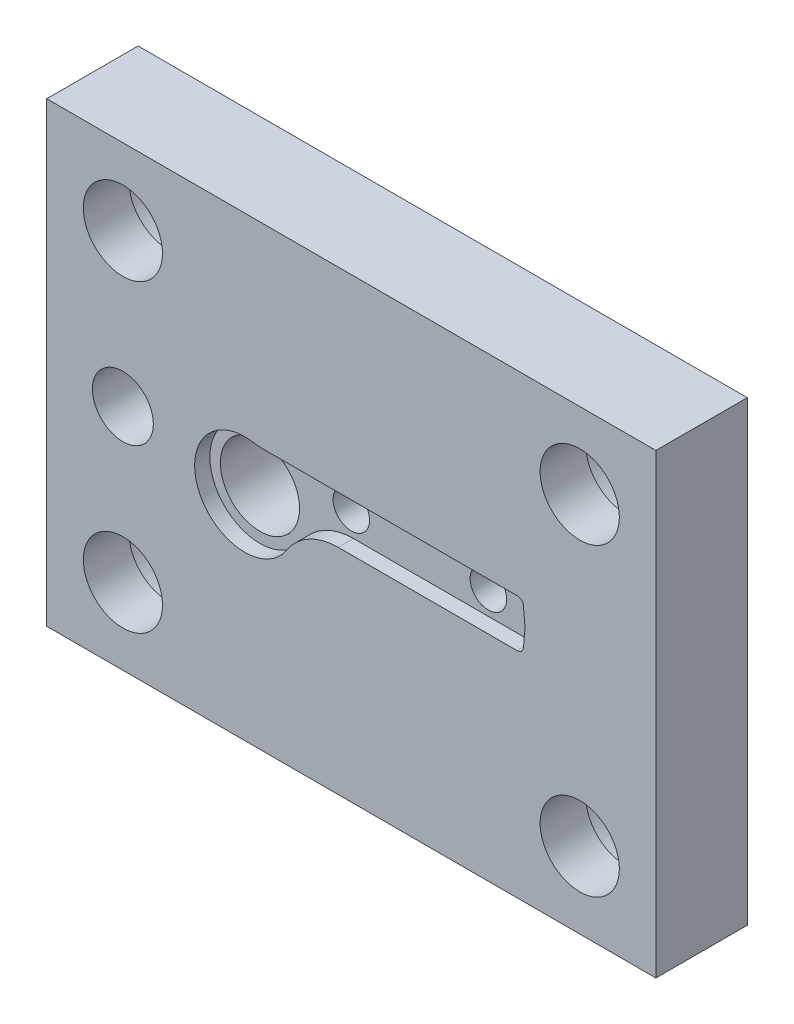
ISO-10303-21;
HEADER;
FILE_DESCRIPTION(('STEP AP214'),'2;1');
FILE_NAME('part.step','',(''),(''),'','','');
FILE_SCHEMA(('AUTOMOTIVE_DESIGN { 1 0 10303 214 1 1 1 1 }'));
ENDSEC;
DATA;
#1=APPLICATION_CONTEXT('core data for automotive mechanical design processes');
#2=APPLICATION_PROTOCOL_DEFINITION('international standard','automotive_design',2000,#1);
#3=PRODUCT_CONTEXT('',#1,'mechanical');
#4=PRODUCT('Part','Part','',(#3));
#5=PRODUCT_RELATED_PRODUCT_CATEGORY('part','',(#4));
#6=PRODUCT_DEFINITION_FORMATION('','',#4);
#7=PRODUCT_DEFINITION_CONTEXT('part definition',#1,'design');
#8=PRODUCT_DEFINITION('design','',#6,#7);
#9=PRODUCT_DEFINITION_SHAPE('','',#8);
#10=(LENGTH_UNIT() NAMED_UNIT(*) SI_UNIT(.MILLI.,.METRE.));
#11=(NAMED_UNIT(*) PLANE_ANGLE_UNIT() SI_UNIT($,.RADIAN.));
#12=(NAMED_UNIT(*) SI_UNIT($,.STERADIAN.) SOLID_ANGLE_UNIT());
#13=UNCERTAINTY_MEASURE_WITH_UNIT(LENGTH_MEASURE(1.E-05),#10,'distance_accuracy_value','');
#14=(GEOMETRIC_REPRESENTATION_CONTEXT(3) GLOBAL_UNCERTAINTY_ASSIGNED_CONTEXT((#13)) GLOBAL_UNIT_ASSIGNED_CONTEXT((#10,
#11,#12)) REPRESENTATION_CONTEXT('',''));
#15=CARTESIAN_POINT('',(0.,0.,0.));
#16=DIRECTION('',(0.,0.,1.));
#17=DIRECTION('',(1.,0.,0.));
#18=AXIS2_PLACEMENT_3D('',#15,#16,#17);
#19=CARTESIAN_POINT('',(0.,0.,30.));
#20=DIRECTION('',(1.,0.,0.));
#21=DIRECTION('',(0.,0.,-1.));
#22=AXIS2_PLACEMENT_3D('',#19,#20,#21);
#23=PLANE('',#22);
#24=DIRECTION('',(0.,-1.,0.));
#25=VECTOR('',#24,1.);
#26=CARTESIAN_POINT('',(0.,0.,0.));
#27=LINE('',#26,#25);
#28=CARTESIAN_POINT('',(0.,150.,0.));
#29=VERTEX_POINT('',#28);
#30=CARTESIAN_POINT('',(0.,0.,0.));
#31=VERTEX_POINT('',#30);
#32=EDGE_CURVE('E203',#29,#31,#27,.T.);
#33=ORIENTED_EDGE('',*,*,#32,.T.);
#34=DIRECTION('',(0.,0.,-1.));
#35=VECTOR('',#34,1.);
#36=CARTESIAN_POINT('',(0.,0.,30.));
#37=LINE('',#36,#35);
#38=CARTESIAN_POINT('',(0.,0.,30.));
#39=VERTEX_POINT('',#38);
#40=EDGE_CURVE('E11',#39,#31,#37,.T.);
#41=ORIENTED_EDGE('',*,*,#40,.F.);
#42=DIRECTION('',(0.,-1.,0.));
#43=VECTOR('',#42,1.);
#44=CARTESIAN_POINT('',(0.,0.,30.));
#45=LINE('',#44,#43);
#46=CARTESIAN_POINT('',(0.,150.,30.));
#47=VERTEX_POINT('',#46);
#48=EDGE_CURVE('E217',#47,#39,#45,.T.);
#49=ORIENTED_EDGE('',*,*,#48,.F.);
#50=DIRECTION('',(0.,0.,-1.));
#51=VECTOR('',#50,1.);
#52=CARTESIAN_POINT('',(0.,150.,30.));
#53=LINE('',#52,#51);
#54=EDGE_CURVE('E223',#47,#29,#53,.T.);
#55=ORIENTED_EDGE('',*,*,#54,.T.);
#56=EDGE_LOOP('',(#33,#41,#49,#55));
#57=FACE_BOUND('',#56,.T.);
#58=ADVANCED_FACE('F31',(#57),#23,.F.);
#59=CARTESIAN_POINT('',(0.,0.,30.));
#60=DIRECTION('',(0.,1.,0.));
#61=DIRECTION('',(0.,0.,1.));
#62=AXIS2_PLACEMENT_3D('',#59,#60,#61);
#63=PLANE('',#62);
#64=DIRECTION('',(1.,0.,0.));
#65=VECTOR('',#64,1.);
#66=CARTESIAN_POINT('',(0.,0.,0.));
#67=LINE('',#66,#65);
#68=CARTESIAN_POINT('',(200.,0.,0.));
#69=VERTEX_POINT('',#68);
#70=EDGE_CURVE('E226',#31,#69,#67,.T.);
#71=ORIENTED_EDGE('',*,*,#70,.T.);
#72=DIRECTION('',(0.,0.,-1.));
#73=VECTOR('',#72,1.);
#74=CARTESIAN_POINT('',(200.,0.,30.));
#75=LINE('',#74,#73);
#76=CARTESIAN_POINT('',(200.,0.,30.));
#77=VERTEX_POINT('',#76);
#78=EDGE_CURVE('E38',#77,#69,#75,.T.);
#79=ORIENTED_EDGE('',*,*,#78,.F.);
#80=DIRECTION('',(1.,0.,0.));
#81=VECTOR('',#80,1.);
#82=CARTESIAN_POINT('',(0.,0.,30.));
#83=LINE('',#82,#81);
#84=EDGE_CURVE('E82',#39,#77,#83,.T.);
#85=ORIENTED_EDGE('',*,*,#84,.F.);
#86=ORIENTED_EDGE('',*,*,#40,.T.);
#87=EDGE_LOOP('',(#71,#79,#85,#86));
#88=FACE_BOUND('',#87,.T.);
#89=ADVANCED_FACE('F255',(#88),#63,.F.);
#90=CARTESIAN_POINT('',(200.,0.,30.));
#91=DIRECTION('',(-1.,0.,0.));
#92=DIRECTION('',(0.,0.,1.));
#93=AXIS2_PLACEMENT_3D('',#90,#91,#92);
#94=PLANE('',#93);
#95=DIRECTION('',(0.,1.,0.));
#96=VECTOR('',#95,1.);
#97=CARTESIAN_POINT('',(200.,0.,0.));
#98=LINE('',#97,#96);
#99=CARTESIAN_POINT('',(200.,150.,0.));
#100=VERTEX_POINT('',#99);
#101=EDGE_CURVE('E228',#69,#100,#98,.T.);
#102=ORIENTED_EDGE('',*,*,#101,.T.);
#103=DIRECTION('',(0.,0.,-1.));
#104=VECTOR('',#103,1.);
#105=CARTESIAN_POINT('',(200.,150.,30.));
#106=LINE('',#105,#104);
#107=CARTESIAN_POINT('',(200.,150.,30.));
#108=VERTEX_POINT('',#107);
#109=EDGE_CURVE('E232',#108,#100,#106,.T.);
#110=ORIENTED_EDGE('',*,*,#109,.F.);
#111=DIRECTION('',(0.,1.,0.));
#112=VECTOR('',#111,1.);
#113=CARTESIAN_POINT('',(200.,0.,30.));
#114=LINE('',#113,#112);
#115=EDGE_CURVE('E220',#77,#108,#114,.T.);
#116=ORIENTED_EDGE('',*,*,#115,.F.);
#117=ORIENTED_EDGE('',*,*,#78,.T.);
#118=EDGE_LOOP('',(#102,#110,#116,#117));
#119=FACE_BOUND('',#118,.T.);
#120=ADVANCED_FACE('F237',(#119),#94,.F.);
#121=CARTESIAN_POINT('',(0.,150.,30.));
#122=DIRECTION('',(0.,-1.,0.));
#123=DIRECTION('',(0.,0.,-1.));
#124=AXIS2_PLACEMENT_3D('',#121,#122,#123);
#125=PLANE('',#124);
#126=DIRECTION('',(-1.,0.,0.));
#127=VECTOR('',#126,1.);
#128=CARTESIAN_POINT('',(0.,150.,0.));
#129=LINE('',#128,#127);
#130=EDGE_CURVE('E75',#100,#29,#129,.T.);
#131=ORIENTED_EDGE('',*,*,#130,.T.);
#132=ORIENTED_EDGE('',*,*,#54,.F.);
#133=DIRECTION('',(-1.,0.,0.));
#134=VECTOR('',#133,1.);
#135=CARTESIAN_POINT('',(0.,150.,30.));
#136=LINE('',#135,#134);
#137=EDGE_CURVE('E54',#108,#47,#136,.T.);
#138=ORIENTED_EDGE('',*,*,#137,.F.);
#139=ORIENTED_EDGE('',*,*,#109,.T.);
#140=EDGE_LOOP('',(#131,#132,#138,#139));
#141=FACE_BOUND('',#140,.T.);
#142=ADVANCED_FACE('F245',(#141),#125,.F.);
#143=CARTESIAN_POINT('',(0.,150.,30.));
#144=DIRECTION('',(0.,0.,-1.));
#145=DIRECTION('',(-1.,0.,0.));
#146=AXIS2_PLACEMENT_3D('',#143,#144,#145);
#147=PLANE('',#146);
#148=CARTESIAN_POINT('',(25.,75.,30.));
#149=DIRECTION('',(0.,0.,1.));
#150=DIRECTION('',(1.,0.,0.));
#151=AXIS2_PLACEMENT_3D('',#148,#149,#150);
#152=CIRCLE('',#151,10.);
#153=CARTESIAN_POINT('',(35.,75.,30.));
#154=VERTEX_POINT('',#153);
#155=EDGE_CURVE('E611',#154,#154,#152,.T.);
#156=ORIENTED_EDGE('',*,*,#155,.F.);
#157=EDGE_LOOP('',(#156));
#158=FACE_BOUND('',#157,.T.);
#159=CARTESIAN_POINT('',(175.,125.,30.));
#160=DIRECTION('',(0.,0.,1.));
#161=DIRECTION('',(1.,0.,0.));
#162=AXIS2_PLACEMENT_3D('',#159,#160,#161);
#163=CIRCLE('',#162,13.);
#164=CARTESIAN_POINT('',(188.,125.,30.));
#165=VERTEX_POINT('',#164);
#166=EDGE_CURVE('E657',#165,#165,#163,.T.);
#167=ORIENTED_EDGE('',*,*,#166,.F.);
#168=EDGE_LOOP('',(#167));
#169=FACE_BOUND('',#168,.T.);
#170=CARTESIAN_POINT('',(175.,25.,30.));
#171=DIRECTION('',(0.,0.,1.));
#172=DIRECTION('',(1.,0.,0.));
#173=AXIS2_PLACEMENT_3D('',#170,#171,#172);
#174=CIRCLE('',#173,13.);
#175=CARTESIAN_POINT('',(188.,25.,30.));
#176=VERTEX_POINT('',#175);
#177=EDGE_CURVE('E660',#176,#176,#174,.T.);
#178=ORIENTED_EDGE('',*,*,#177,.F.);
#179=EDGE_LOOP('',(#178));
#180=FACE_BOUND('',#179,.T.);
#181=CARTESIAN_POINT('',(25.,25.,30.));
#182=DIRECTION('',(0.,0.,1.));
#183=DIRECTION('',(1.,0.,0.));
#184=AXIS2_PLACEMENT_3D('',#181,#182,#183);
#185=CIRCLE('',#184,13.);
#186=CARTESIAN_POINT('',(38.,25.,30.));
#187=VERTEX_POINT('',#186);
#188=EDGE_CURVE('E663',#187,#187,#185,.T.);
#189=ORIENTED_EDGE('',*,*,#188,.F.);
#190=EDGE_LOOP('',(#189));
#191=FACE_BOUND('',#190,.T.);
#192=CARTESIAN_POINT('',(25.,125.,30.));
#193=DIRECTION('',(0.,0.,1.));
#194=DIRECTION('',(1.,0.,0.));
#195=AXIS2_PLACEMENT_3D('',#192,#193,#194);
#196=CIRCLE('',#195,13.);
#197=CARTESIAN_POINT('',(38.,125.,30.));
#198=VERTEX_POINT('',#197);
#199=EDGE_CURVE('E666',#198,#198,#196,.T.);
#200=ORIENTED_EDGE('',*,*,#199,.F.);
#201=EDGE_LOOP('',(#200));
#202=FACE_BOUND('',#201,.T.);
#203=CARTESIAN_POINT('',(65.,70.,30.));
#204=DIRECTION('',(0.,0.,1.));
#205=DIRECTION('',(1.,0.,0.));
#206=AXIS2_PLACEMENT_3D('',#203,#204,#205);
#207=CIRCLE('',#206,16.445);
#208=CARTESIAN_POINT('',(67.7403932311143,86.2150630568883,30.));
#209=VERTEX_POINT('',#208);
#210=CARTESIAN_POINT('',(78.8329287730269,61.1068505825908,30.));
#211=VERTEX_POINT('',#210);
#212=EDGE_CURVE('E181',#209,#211,#207,.T.);
#213=ORIENTED_EDGE('',*,*,#212,.F.);
#214=CARTESIAN_POINT('',(71.0781905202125,105.965,30.));
#215=DIRECTION('',(0.,0.,-1.));
#216=DIRECTION('',(-1.,0.,0.));
#217=AXIS2_PLACEMENT_3D('',#214,#215,#216);
#218=CIRCLE('',#217,20.03);
#219=CARTESIAN_POINT('',(71.0781905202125,85.935,30.));
#220=VERTEX_POINT('',#219);
#221=EDGE_CURVE('E45',#220,#209,#218,.T.);
#222=ORIENTED_EDGE('',*,*,#221,.F.);
#223=DIRECTION('',(-1.,0.,0.));
#224=VECTOR('',#223,1.);
#225=CARTESIAN_POINT('',(71.0781905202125,85.935,30.));
#226=LINE('',#225,#224);
#227=CARTESIAN_POINT('',(154.489847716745,85.935,30.));
#228=VERTEX_POINT('',#227);
#229=EDGE_CURVE('E155',#228,#220,#226,.T.);
#230=ORIENTED_EDGE('',*,*,#229,.F.);
#231=CARTESIAN_POINT('',(154.489847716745,83.905,30.));
#232=DIRECTION('',(0.,0.,1.));
#233=DIRECTION('',(-1.,0.,0.));
#234=AXIS2_PLACEMENT_3D('',#231,#232,#233);
#235=CIRCLE('',#234,2.03000000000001);
#236=CARTESIAN_POINT('',(156.512122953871,84.0819261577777,30.));
#237=VERTEX_POINT('',#236);
#238=EDGE_CURVE('E158',#237,#228,#235,.T.);
#239=ORIENTED_EDGE('',*,*,#238,.F.);
#240=DIRECTION('',(-0.0871557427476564,0.996194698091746,0.));
#241=VECTOR('',#240,1.);
#242=CARTESIAN_POINT('',(156.512122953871,84.0819261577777,30.));
#243=LINE('',#242,#241);
#244=CARTESIAN_POINT('',(157.033723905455,78.12,30.));
#245=VERTEX_POINT('',#244);
#246=EDGE_CURVE('E196',#245,#237,#243,.T.);
#247=ORIENTED_EDGE('',*,*,#246,.F.);
#248=DIRECTION('',(0.0871557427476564,0.996194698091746,0.));
#249=VECTOR('',#248,1.);
#250=CARTESIAN_POINT('',(156.512122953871,72.1580738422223,30.));
#251=LINE('',#250,#249);
#252=CARTESIAN_POINT('',(156.512122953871,72.1580738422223,30.));
#253=VERTEX_POINT('',#252);
#254=EDGE_CURVE('E193',#253,#245,#251,.T.);
#255=ORIENTED_EDGE('',*,*,#254,.F.);
#256=CARTESIAN_POINT('',(154.489847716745,72.335,30.));
#257=DIRECTION('',(0.,0.,1.));
#258=DIRECTION('',(1.,0.,0.));
#259=AXIS2_PLACEMENT_3D('',#256,#257,#258);
#260=CIRCLE('',#259,2.03000000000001);
#261=CARTESIAN_POINT('',(154.489847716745,70.305,30.));
#262=VERTEX_POINT('',#261);
#263=EDGE_CURVE('E190',#262,#253,#260,.T.);
#264=ORIENTED_EDGE('',*,*,#263,.F.);
#265=DIRECTION('',(1.,0.,0.));
#266=VECTOR('',#265,1.);
#267=CARTESIAN_POINT('',(95.6814276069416,70.305,30.));
#268=LINE('',#267,#266);
#269=CARTESIAN_POINT('',(95.6814276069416,70.305,30.));
#270=VERTEX_POINT('',#269);
#271=EDGE_CURVE('E187',#270,#262,#268,.T.);
#272=ORIENTED_EDGE('',*,*,#271,.F.);
#273=CARTESIAN_POINT('',(95.6814276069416,50.275,30.));
#274=DIRECTION('',(0.,0.,-1.));
#275=DIRECTION('',(1.,0.,0.));
#276=AXIS2_PLACEMENT_3D('',#273,#274,#275);
#277=CIRCLE('',#276,20.03);
#278=EDGE_CURVE('E184',#211,#270,#277,.T.);
#279=ORIENTED_EDGE('',*,*,#278,.F.);
#280=EDGE_LOOP('',(#213,#222,#230,#239,#247,#255,#264,#272,#279));
#281=FACE_BOUND('',#280,.T.);
#282=ORIENTED_EDGE('',*,*,#48,.T.);
#283=ORIENTED_EDGE('',*,*,#84,.T.);
#284=ORIENTED_EDGE('',*,*,#115,.T.);
#285=ORIENTED_EDGE('',*,*,#137,.T.);
#286=EDGE_LOOP('',(#282,#283,#284,#285));
#287=FACE_BOUND('',#286,.T.);
#288=ADVANCED_FACE('F247',(#158,#169,#180,#191,#202,#281,#287),#147,.F.);
#289=CARTESIAN_POINT('',(0.,150.,0.));
#290=DIRECTION('',(0.,0.,-1.));
#291=DIRECTION('',(-1.,0.,0.));
#292=AXIS2_PLACEMENT_3D('',#289,#290,#291);
#293=PLANE('',#292);
#294=CARTESIAN_POINT('',(25.,75.,0.));
#295=DIRECTION('',(0.,0.,1.));
#296=DIRECTION('',(1.,0.,0.));
#297=AXIS2_PLACEMENT_3D('',#294,#295,#296);
#298=CIRCLE('',#297,5.99999999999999);
#299=CARTESIAN_POINT('',(31.,75.,0.));
#300=VERTEX_POINT('',#299);
#301=EDGE_CURVE('E618',#300,#300,#298,.T.);
#302=ORIENTED_EDGE('',*,*,#301,.T.);
#303=EDGE_LOOP('',(#302));
#304=FACE_BOUND('',#303,.T.);
#305=CARTESIAN_POINT('',(25.,25.,0.));
#306=DIRECTION('',(0.,0.,1.));
#307=DIRECTION('',(1.,0.,0.));
#308=AXIS2_PLACEMENT_3D('',#305,#306,#307);
#309=CIRCLE('',#308,20.);
#310=CARTESIAN_POINT('',(45.,25.,0.));
#311=VERTEX_POINT('',#310);
#312=EDGE_CURVE('E622',#311,#311,#309,.T.);
#313=ORIENTED_EDGE('',*,*,#312,.T.);
#314=EDGE_LOOP('',(#313));
#315=FACE_BOUND('',#314,.T.);
#316=CARTESIAN_POINT('',(175.,25.,0.));
#317=DIRECTION('',(0.,0.,1.));
#318=DIRECTION('',(1.,0.,0.));
#319=AXIS2_PLACEMENT_3D('',#316,#317,#318);
#320=CIRCLE('',#319,20.);
#321=CARTESIAN_POINT('',(195.,25.,0.));
#322=VERTEX_POINT('',#321);
#323=EDGE_CURVE('E631',#322,#322,#320,.T.);
#324=ORIENTED_EDGE('',*,*,#323,.T.);
#325=EDGE_LOOP('',(#324));
#326=FACE_BOUND('',#325,.T.);
#327=CARTESIAN_POINT('',(175.,125.,0.));
#328=DIRECTION('',(0.,0.,1.));
#329=DIRECTION('',(1.,0.,0.));
#330=AXIS2_PLACEMENT_3D('',#327,#328,#329);
#331=CIRCLE('',#330,20.);
#332=CARTESIAN_POINT('',(195.,125.,0.));
#333=VERTEX_POINT('',#332);
#334=EDGE_CURVE('E640',#333,#333,#331,.T.);
#335=ORIENTED_EDGE('',*,*,#334,.T.);
#336=EDGE_LOOP('',(#335));
#337=FACE_BOUND('',#336,.T.);
#338=CARTESIAN_POINT('',(25.,125.,0.));
#339=DIRECTION('',(0.,0.,1.));
#340=DIRECTION('',(1.,0.,0.));
#341=AXIS2_PLACEMENT_3D('',#338,#339,#340);
#342=CIRCLE('',#341,20.);
#343=CARTESIAN_POINT('',(45.,125.,0.));
#344=VERTEX_POINT('',#343);
#345=EDGE_CURVE('E649',#344,#344,#342,.T.);
#346=ORIENTED_EDGE('',*,*,#345,.T.);
#347=EDGE_LOOP('',(#346));
#348=FACE_BOUND('',#347,.T.);
#349=CARTESIAN_POINT('',(95.,78.12,0.));
#350=DIRECTION('',(0.,0.,1.));
#351=DIRECTION('',(1.,0.,0.));
#352=AXIS2_PLACEMENT_3D('',#349,#350,#351);
#353=CIRCLE('',#352,8.99999999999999);
#354=CARTESIAN_POINT('',(104.,78.12,0.));
#355=VERTEX_POINT('',#354);
#356=EDGE_CURVE('E670',#355,#355,#353,.T.);
#357=ORIENTED_EDGE('',*,*,#356,.T.);
#358=EDGE_LOOP('',(#357));
#359=FACE_BOUND('',#358,.T.);
#360=CARTESIAN_POINT('',(140.,78.12,0.));
#361=DIRECTION('',(0.,0.,1.));
#362=DIRECTION('',(1.,0.,0.));
#363=AXIS2_PLACEMENT_3D('',#360,#361,#362);
#364=CIRCLE('',#363,9.00000000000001);
#365=CARTESIAN_POINT('',(149.,78.12,0.));
#366=VERTEX_POINT('',#365);
#367=EDGE_CURVE('E679',#366,#366,#364,.T.);
#368=ORIENTED_EDGE('',*,*,#367,.T.);
#369=EDGE_LOOP('',(#368));
#370=FACE_BOUND('',#369,.T.);
#371=CARTESIAN_POINT('',(65.,70.,0.));
#372=DIRECTION('',(0.,0.,1.));
#373=DIRECTION('',(1.,0.,0.));
#374=AXIS2_PLACEMENT_3D('',#371,#372,#373);
#375=CIRCLE('',#374,13.);
#376=CARTESIAN_POINT('',(78.,70.,0.));
#377=VERTEX_POINT('',#376);
#378=EDGE_CURVE('E182',#377,#377,#375,.T.);
#379=ORIENTED_EDGE('',*,*,#378,.T.);
#380=EDGE_LOOP('',(#379));
#381=FACE_BOUND('',#380,.T.);
#382=ORIENTED_EDGE('',*,*,#32,.F.);
#383=ORIENTED_EDGE('',*,*,#130,.F.);
#384=ORIENTED_EDGE('',*,*,#101,.F.);
#385=ORIENTED_EDGE('',*,*,#70,.F.);
#386=EDGE_LOOP('',(#382,#383,#384,#385));
#387=FACE_BOUND('',#386,.T.);
#388=ADVANCED_FACE('F241',(#304,#315,#326,#337,#348,#359,#370,#381,#387),#293,.T.);
#389=CARTESIAN_POINT('',(71.0781905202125,105.965,25.));
#390=DIRECTION('',(0.,0.,1.));
#391=DIRECTION('',(1.,0.,0.));
#392=AXIS2_PLACEMENT_3D('',#389,#390,#391);
#393=CYLINDRICAL_SURFACE('',#392,20.03);
#394=ORIENTED_EDGE('',*,*,#221,.T.);
#395=DIRECTION('',(0.,0.,1.));
#396=VECTOR('',#395,1.);
#397=CARTESIAN_POINT('',(67.7403932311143,86.2150630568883,25.));
#398=LINE('',#397,#396);
#399=CARTESIAN_POINT('',(67.7403932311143,86.2150630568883,25.));
#400=VERTEX_POINT('',#399);
#401=EDGE_CURVE('E132',#400,#209,#398,.T.);
#402=ORIENTED_EDGE('',*,*,#401,.F.);
#403=CARTESIAN_POINT('',(71.0781905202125,105.965,25.));
#404=DIRECTION('',(0.,0.,-1.));
#405=DIRECTION('',(-1.,0.,0.));
#406=AXIS2_PLACEMENT_3D('',#403,#404,#405);
#407=CIRCLE('',#406,20.03);
#408=CARTESIAN_POINT('',(71.0781905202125,85.935,25.));
#409=VERTEX_POINT('',#408);
#410=EDGE_CURVE('E136',#409,#400,#407,.T.);
#411=ORIENTED_EDGE('',*,*,#410,.F.);
#412=DIRECTION('',(0.,0.,1.));
#413=VECTOR('',#412,1.);
#414=CARTESIAN_POINT('',(71.0781905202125,85.935,25.));
#415=LINE('',#414,#413);
#416=EDGE_CURVE('E201',#409,#220,#415,.T.);
#417=ORIENTED_EDGE('',*,*,#416,.T.);
#418=EDGE_LOOP('',(#394,#402,#411,#417));
#419=FACE_BOUND('',#418,.T.);
#420=ADVANCED_FACE('F134',(#419),#393,.T.);
#421=CARTESIAN_POINT('',(71.0781905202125,85.935,25.));
#422=DIRECTION('',(0.,1.,0.));
#423=DIRECTION('',(0.,0.,1.));
#424=AXIS2_PLACEMENT_3D('',#421,#422,#423);
#425=PLANE('',#424);
#426=ORIENTED_EDGE('',*,*,#229,.T.);
#427=ORIENTED_EDGE('',*,*,#416,.F.);
#428=DIRECTION('',(-1.,0.,0.));
#429=VECTOR('',#428,1.);
#430=CARTESIAN_POINT('',(71.0781905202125,85.935,25.));
#431=LINE('',#430,#429);
#432=CARTESIAN_POINT('',(154.489847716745,85.935,25.));
#433=VERTEX_POINT('',#432);
#434=EDGE_CURVE('E142',#433,#409,#431,.T.);
#435=ORIENTED_EDGE('',*,*,#434,.F.);
#436=DIRECTION('',(0.,0.,1.));
#437=VECTOR('',#436,1.);
#438=CARTESIAN_POINT('',(154.489847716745,85.935,25.));
#439=LINE('',#438,#437);
#440=EDGE_CURVE('E204',#433,#228,#439,.T.);
#441=ORIENTED_EDGE('',*,*,#440,.T.);
#442=EDGE_LOOP('',(#426,#427,#435,#441));
#443=FACE_BOUND('',#442,.T.);
#444=ADVANCED_FACE('F282',(#443),#425,.F.);
#445=CARTESIAN_POINT('',(154.489847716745,83.905,25.));
#446=DIRECTION('',(0.,0.,1.));
#447=DIRECTION('',(1.,0.,0.));
#448=AXIS2_PLACEMENT_3D('',#445,#446,#447);
#449=CYLINDRICAL_SURFACE('',#448,2.03000000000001);
#450=ORIENTED_EDGE('',*,*,#238,.T.);
#451=ORIENTED_EDGE('',*,*,#440,.F.);
#452=CARTESIAN_POINT('',(154.489847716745,83.905,25.));
#453=DIRECTION('',(0.,0.,1.));
#454=DIRECTION('',(-1.,0.,0.));
#455=AXIS2_PLACEMENT_3D('',#452,#453,#454);
#456=CIRCLE('',#455,2.03000000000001);
#457=CARTESIAN_POINT('',(156.512122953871,84.0819261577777,25.));
#458=VERTEX_POINT('',#457);
#459=EDGE_CURVE('E177',#458,#433,#456,.T.);
#460=ORIENTED_EDGE('',*,*,#459,.F.);
#461=DIRECTION('',(0.,0.,1.));
#462=VECTOR('',#461,1.);
#463=CARTESIAN_POINT('',(156.512122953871,84.0819261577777,25.));
#464=LINE('',#463,#462);
#465=EDGE_CURVE('E206',#458,#237,#464,.T.);
#466=ORIENTED_EDGE('',*,*,#465,.T.);
#467=EDGE_LOOP('',(#450,#451,#460,#466));
#468=FACE_BOUND('',#467,.T.);
#469=ADVANCED_FACE('F293',(#468),#449,.F.);
#470=CARTESIAN_POINT('',(156.512122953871,84.0819261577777,25.));
#471=DIRECTION('',(0.996194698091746,0.0871557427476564,0.));
#472=DIRECTION('',(-0.0871557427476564,0.996194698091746,0.));
#473=AXIS2_PLACEMENT_3D('',#470,#471,#472);
#474=PLANE('',#473);
#475=ORIENTED_EDGE('',*,*,#246,.T.);
#476=ORIENTED_EDGE('',*,*,#465,.F.);
#477=DIRECTION('',(-0.0871557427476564,0.996194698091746,0.));
#478=VECTOR('',#477,1.);
#479=CARTESIAN_POINT('',(156.512122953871,84.0819261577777,25.));
#480=LINE('',#479,#478);
#481=CARTESIAN_POINT('',(157.033723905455,78.12,25.));
#482=VERTEX_POINT('',#481);
#483=EDGE_CURVE('E174',#482,#458,#480,.T.);
#484=ORIENTED_EDGE('',*,*,#483,.F.);
#485=DIRECTION('',(0.,0.,1.));
#486=VECTOR('',#485,1.);
#487=CARTESIAN_POINT('',(157.033723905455,78.12,25.));
#488=LINE('',#487,#486);
#489=EDGE_CURVE('E208',#482,#245,#488,.T.);
#490=ORIENTED_EDGE('',*,*,#489,.T.);
#491=EDGE_LOOP('',(#475,#476,#484,#490));
#492=FACE_BOUND('',#491,.T.);
#493=ADVANCED_FACE('F303',(#492),#474,.F.);
#494=CARTESIAN_POINT('',(156.512122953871,72.1580738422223,25.));
#495=DIRECTION('',(0.996194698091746,-0.0871557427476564,0.));
#496=DIRECTION('',(0.0871557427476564,0.996194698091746,0.));
#497=AXIS2_PLACEMENT_3D('',#494,#495,#496);
#498=PLANE('',#497);
#499=ORIENTED_EDGE('',*,*,#254,.T.);
#500=ORIENTED_EDGE('',*,*,#489,.F.);
#501=DIRECTION('',(0.0871557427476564,0.996194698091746,0.));
#502=VECTOR('',#501,1.);
#503=CARTESIAN_POINT('',(156.512122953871,72.1580738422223,25.));
#504=LINE('',#503,#502);
#505=CARTESIAN_POINT('',(156.512122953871,72.1580738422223,25.));
#506=VERTEX_POINT('',#505);
#507=EDGE_CURVE('E171',#506,#482,#504,.T.);
#508=ORIENTED_EDGE('',*,*,#507,.F.);
#509=DIRECTION('',(0.,0.,1.));
#510=VECTOR('',#509,1.);
#511=CARTESIAN_POINT('',(156.512122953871,72.1580738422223,25.));
#512=LINE('',#511,#510);
#513=EDGE_CURVE('E210',#506,#253,#512,.T.);
#514=ORIENTED_EDGE('',*,*,#513,.T.);
#515=EDGE_LOOP('',(#499,#500,#508,#514));
#516=FACE_BOUND('',#515,.T.);
#517=ADVANCED_FACE('F313',(#516),#498,.F.);
#518=CARTESIAN_POINT('',(154.489847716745,72.335,25.));
#519=DIRECTION('',(0.,0.,1.));
#520=DIRECTION('',(1.,0.,0.));
#521=AXIS2_PLACEMENT_3D('',#518,#519,#520);
#522=CYLINDRICAL_SURFACE('',#521,2.03000000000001);
#523=ORIENTED_EDGE('',*,*,#263,.T.);
#524=ORIENTED_EDGE('',*,*,#513,.F.);
#525=CARTESIAN_POINT('',(154.489847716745,72.335,25.));
#526=DIRECTION('',(0.,0.,1.));
#527=DIRECTION('',(1.,0.,0.));
#528=AXIS2_PLACEMENT_3D('',#525,#526,#527);
#529=CIRCLE('',#528,2.03000000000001);
#530=CARTESIAN_POINT('',(154.489847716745,70.305,25.));
#531=VERTEX_POINT('',#530);
#532=EDGE_CURVE('E168',#531,#506,#529,.T.);
#533=ORIENTED_EDGE('',*,*,#532,.F.);
#534=DIRECTION('',(0.,0.,1.));
#535=VECTOR('',#534,1.);
#536=CARTESIAN_POINT('',(154.489847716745,70.305,25.));
#537=LINE('',#536,#535);
#538=EDGE_CURVE('E212',#531,#262,#537,.T.);
#539=ORIENTED_EDGE('',*,*,#538,.T.);
#540=EDGE_LOOP('',(#523,#524,#533,#539));
#541=FACE_BOUND('',#540,.T.);
#542=ADVANCED_FACE('F323',(#541),#522,.F.);
#543=CARTESIAN_POINT('',(95.6814276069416,70.305,25.));
#544=DIRECTION('',(0.,-1.,0.));
#545=DIRECTION('',(0.,0.,-1.));
#546=AXIS2_PLACEMENT_3D('',#543,#544,#545);
#547=PLANE('',#546);
#548=ORIENTED_EDGE('',*,*,#271,.T.);
#549=ORIENTED_EDGE('',*,*,#538,.F.);
#550=DIRECTION('',(1.,0.,0.));
#551=VECTOR('',#550,1.);
#552=CARTESIAN_POINT('',(95.6814276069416,70.305,25.));
#553=LINE('',#552,#551);
#554=CARTESIAN_POINT('',(95.6814276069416,70.305,25.));
#555=VERTEX_POINT('',#554);
#556=EDGE_CURVE('E165',#555,#531,#553,.T.);
#557=ORIENTED_EDGE('',*,*,#556,.F.);
#558=DIRECTION('',(0.,0.,1.));
#559=VECTOR('',#558,1.);
#560=CARTESIAN_POINT('',(95.6814276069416,70.305,25.));
#561=LINE('',#560,#559);
#562=EDGE_CURVE('E214',#555,#270,#561,.T.);
#563=ORIENTED_EDGE('',*,*,#562,.T.);
#564=EDGE_LOOP('',(#548,#549,#557,#563));
#565=FACE_BOUND('',#564,.T.);
#566=ADVANCED_FACE('F333',(#565),#547,.F.);
#567=CARTESIAN_POINT('',(95.6814276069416,50.275,25.));
#568=DIRECTION('',(0.,0.,1.));
#569=DIRECTION('',(1.,0.,0.));
#570=AXIS2_PLACEMENT_3D('',#567,#568,#569);
#571=CYLINDRICAL_SURFACE('',#570,20.03);
#572=ORIENTED_EDGE('',*,*,#278,.T.);
#573=ORIENTED_EDGE('',*,*,#562,.F.);
#574=CARTESIAN_POINT('',(95.6814276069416,50.275,25.));
#575=DIRECTION('',(0.,0.,-1.));
#576=DIRECTION('',(1.,0.,0.));
#577=AXIS2_PLACEMENT_3D('',#574,#575,#576);
#578=CIRCLE('',#577,20.03);
#579=CARTESIAN_POINT('',(78.8329287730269,61.1068505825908,25.));
#580=VERTEX_POINT('',#579);
#581=EDGE_CURVE('E150',#580,#555,#578,.T.);
#582=ORIENTED_EDGE('',*,*,#581,.F.);
#583=DIRECTION('',(0.,0.,1.));
#584=VECTOR('',#583,1.);
#585=CARTESIAN_POINT('',(78.8329287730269,61.1068505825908,25.));
#586=LINE('',#585,#584);
#587=EDGE_CURVE('E141',#580,#211,#586,.T.);
#588=ORIENTED_EDGE('',*,*,#587,.T.);
#589=EDGE_LOOP('',(#572,#573,#582,#588));
#590=FACE_BOUND('',#589,.T.);
#591=ADVANCED_FACE('F343',(#590),#571,.T.);
#592=CARTESIAN_POINT('',(65.,70.,25.));
#593=DIRECTION('',(0.,0.,1.));
#594=DIRECTION('',(1.,0.,0.));
#595=AXIS2_PLACEMENT_3D('',#592,#593,#594);
#596=CYLINDRICAL_SURFACE('',#595,16.445);
#597=ORIENTED_EDGE('',*,*,#212,.T.);
#598=ORIENTED_EDGE('',*,*,#587,.F.);
#599=CARTESIAN_POINT('',(65.,70.,25.));
#600=DIRECTION('',(0.,0.,1.));
#601=DIRECTION('',(1.,0.,0.));
#602=AXIS2_PLACEMENT_3D('',#599,#600,#601);
#603=CIRCLE('',#602,16.445);
#604=EDGE_CURVE('E145',#400,#580,#603,.T.);
#605=ORIENTED_EDGE('',*,*,#604,.F.);
#606=ORIENTED_EDGE('',*,*,#401,.T.);
#607=EDGE_LOOP('',(#597,#598,#605,#606));
#608=FACE_BOUND('',#607,.T.);
#609=ADVANCED_FACE('F146',(#608),#596,.F.);
#610=CARTESIAN_POINT('',(71.0781905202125,105.965,25.));
#611=DIRECTION('',(0.,0.,-1.));
#612=DIRECTION('',(-1.,0.,0.));
#613=AXIS2_PLACEMENT_3D('',#610,#611,#612);
#614=PLANE('',#613);
#615=CARTESIAN_POINT('',(95.,78.12,25.));
#616=DIRECTION('',(0.,0.,1.));
#617=DIRECTION('',(1.,0.,0.));
#618=AXIS2_PLACEMENT_3D('',#615,#616,#617);
#619=CIRCLE('',#618,6.);
#620=CARTESIAN_POINT('',(101.,78.12,25.));
#621=VERTEX_POINT('',#620);
#622=EDGE_CURVE('E687',#621,#621,#619,.T.);
#623=ORIENTED_EDGE('',*,*,#622,.F.);
#624=EDGE_LOOP('',(#623));
#625=FACE_BOUND('',#624,.T.);
#626=CARTESIAN_POINT('',(140.,78.12,25.));
#627=DIRECTION('',(0.,0.,1.));
#628=DIRECTION('',(1.,0.,0.));
#629=AXIS2_PLACEMENT_3D('',#626,#627,#628);
#630=CIRCLE('',#629,6.00000000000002);
#631=CARTESIAN_POINT('',(146.,78.12,25.));
#632=VERTEX_POINT('',#631);
#633=EDGE_CURVE('E690',#632,#632,#630,.T.);
#634=ORIENTED_EDGE('',*,*,#633,.F.);
#635=EDGE_LOOP('',(#634));
#636=FACE_BOUND('',#635,.T.);
#637=CARTESIAN_POINT('',(65.,70.,25.));
#638=DIRECTION('',(0.,0.,1.));
#639=DIRECTION('',(1.,0.,0.));
#640=AXIS2_PLACEMENT_3D('',#637,#638,#639);
#641=CIRCLE('',#640,13.);
#642=CARTESIAN_POINT('',(78.,70.,25.));
#643=VERTEX_POINT('',#642);
#644=EDGE_CURVE('E161',#643,#643,#641,.T.);
#645=ORIENTED_EDGE('',*,*,#644,.F.);
#646=EDGE_LOOP('',(#645));
#647=FACE_BOUND('',#646,.T.);
#648=ORIENTED_EDGE('',*,*,#410,.T.);
#649=ORIENTED_EDGE('',*,*,#604,.T.);
#650=ORIENTED_EDGE('',*,*,#581,.T.);
#651=ORIENTED_EDGE('',*,*,#556,.T.);
#652=ORIENTED_EDGE('',*,*,#532,.T.);
#653=ORIENTED_EDGE('',*,*,#507,.T.);
#654=ORIENTED_EDGE('',*,*,#483,.T.);
#655=ORIENTED_EDGE('',*,*,#459,.T.);
#656=ORIENTED_EDGE('',*,*,#434,.T.);
#657=EDGE_LOOP('',(#648,#649,#650,#651,#652,#653,#654,#655,#656));
#658=FACE_BOUND('',#657,.T.);
#659=ADVANCED_FACE('F152',(#625,#636,#647,#658),#614,.F.);
#660=CARTESIAN_POINT('',(65.,70.,0.));
#661=DIRECTION('',(0.,0.,1.));
#662=DIRECTION('',(1.,0.,0.));
#663=AXIS2_PLACEMENT_3D('',#660,#661,#662);
#664=CYLINDRICAL_SURFACE('',#663,13.);
#665=CARTESIAN_POINT('',(78.,70.,0.));
#666=CARTESIAN_POINT('',(78.,70.,0.260416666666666));
#667=CARTESIAN_POINT('',(78.,70.,0.520833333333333));
#668=CARTESIAN_POINT('',(78.,70.,1.04166666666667));
#669=CARTESIAN_POINT('',(78.,70.,1.30208333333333));
#670=CARTESIAN_POINT('',(78.,70.,1.82291666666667));
#671=CARTESIAN_POINT('',(78.,70.,2.08333333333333));
#672=CARTESIAN_POINT('',(78.,70.,2.60416666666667));
#673=CARTESIAN_POINT('',(78.,70.,2.86458333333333));
#674=CARTESIAN_POINT('',(78.,70.,3.38541666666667));
#675=CARTESIAN_POINT('',(78.,70.,3.64583333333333));
#676=CARTESIAN_POINT('',(78.,70.,4.16666666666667));
#677=CARTESIAN_POINT('',(78.,70.,4.42708333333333));
#678=CARTESIAN_POINT('',(78.,70.,4.94791666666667));
#679=CARTESIAN_POINT('',(78.,70.,5.20833333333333));
#680=CARTESIAN_POINT('',(78.,70.,5.72916666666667));
#681=CARTESIAN_POINT('',(78.,70.,5.98958333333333));
#682=CARTESIAN_POINT('',(78.,70.,6.51041666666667));
#683=CARTESIAN_POINT('',(78.,70.,6.77083333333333));
#684=CARTESIAN_POINT('',(78.,70.,7.29166666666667));
#685=CARTESIAN_POINT('',(78.,70.,7.55208333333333));
#686=CARTESIAN_POINT('',(78.,70.,8.07291666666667));
#687=CARTESIAN_POINT('',(78.,70.,8.33333333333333));
#688=CARTESIAN_POINT('',(78.,70.,8.85416666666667));
#689=CARTESIAN_POINT('',(78.,70.,9.11458333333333));
#690=CARTESIAN_POINT('',(78.,70.,9.63541666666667));
#691=CARTESIAN_POINT('',(78.,70.,9.89583333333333));
#692=CARTESIAN_POINT('',(78.,70.,10.4166666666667));
#693=CARTESIAN_POINT('',(78.,70.,10.6770833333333));
#694=CARTESIAN_POINT('',(78.,70.,11.1979166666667));
#695=CARTESIAN_POINT('',(78.,70.,11.4583333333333));
#696=CARTESIAN_POINT('',(78.,70.,11.9791666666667));
#697=CARTESIAN_POINT('',(78.,70.,12.2395833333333));
#698=CARTESIAN_POINT('',(78.,70.,12.7604166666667));
#699=CARTESIAN_POINT('',(78.,70.,13.0208333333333));
#700=CARTESIAN_POINT('',(78.,70.,13.5416666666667));
#701=CARTESIAN_POINT('',(78.,70.,13.8020833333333));
#702=CARTESIAN_POINT('',(78.,70.,14.3229166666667));
#703=CARTESIAN_POINT('',(78.,70.,14.5833333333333));
#704=CARTESIAN_POINT('',(78.,70.,15.1041666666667));
#705=CARTESIAN_POINT('',(78.,70.,15.3645833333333));
#706=CARTESIAN_POINT('',(78.,70.,15.8854166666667));
#707=CARTESIAN_POINT('',(78.,70.,16.1458333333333));
#708=CARTESIAN_POINT('',(78.,70.,16.6666666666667));
#709=CARTESIAN_POINT('',(78.,70.,16.9270833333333));
#710=CARTESIAN_POINT('',(78.,70.,17.4479166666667));
#711=CARTESIAN_POINT('',(78.,70.,17.7083333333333));
#712=CARTESIAN_POINT('',(78.,70.,18.2291666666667));
#713=CARTESIAN_POINT('',(78.,70.,18.4895833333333));
#714=CARTESIAN_POINT('',(78.,70.,19.0104166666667));
#715=CARTESIAN_POINT('',(78.,70.,19.2708333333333));
#716=CARTESIAN_POINT('',(78.,70.,19.7916666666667));
#717=CARTESIAN_POINT('',(78.,70.,20.0520833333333));
#718=CARTESIAN_POINT('',(78.,70.,20.5729166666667));
#719=CARTESIAN_POINT('',(78.,70.,20.8333333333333));
#720=CARTESIAN_POINT('',(78.,70.,21.3541666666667));
#721=CARTESIAN_POINT('',(78.,70.,21.6145833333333));
#722=CARTESIAN_POINT('',(78.,70.,22.1354166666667));
#723=CARTESIAN_POINT('',(78.,70.,22.3958333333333));
#724=CARTESIAN_POINT('',(78.,70.,22.9166666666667));
#725=CARTESIAN_POINT('',(78.,70.,23.1770833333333));
#726=CARTESIAN_POINT('',(78.,70.,23.6979166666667));
#727=CARTESIAN_POINT('',(78.,70.,23.9583333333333));
#728=CARTESIAN_POINT('',(78.,70.,24.4791666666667));
#729=CARTESIAN_POINT('',(78.,70.,24.7395833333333));
#730=CARTESIAN_POINT('',(78.,70.,25.));
#731=B_SPLINE_CURVE_WITH_KNOTS('',3,(#665,#666,#667,#668,#669,#670,#671,#672,#673,#674,#675,
#676,#677,#678,#679,#680,#681,#682,#683,#684,#685,#686,#687,#688,#689,#690,#691,#692,#693,#694,
#695,#696,#697,#698,#699,#700,#701,#702,#703,#704,#705,#706,#707,#708,#709,#710,#711,#712,#713,
#714,#715,#716,#717,#718,#719,#720,#721,#722,#723,#724,#725,#726,#727,#728,#729,#730),
.UNSPECIFIED.,.F.,.F.,(4,2,2,2,2,2,2,2,2,2,2,2,2,2,2,2,2,2,2,2,2,2,2,2,2,2,2,2,2,2,2,2,4),(0.,
0.78125,1.5625,2.34375,3.125,3.90625,4.6875,5.46875,6.25,7.03125,7.8125,8.59375,9.375,10.15625,
10.9375,11.71875,12.5,13.28125,14.0625,14.84375,15.625,16.40625,17.1875,17.96875,18.75,19.53125,
20.3125,21.09375,21.875,22.65625,23.4375,24.21875,25.),.UNSPECIFIED.);
#732=EDGE_CURVE('BSEAM368',#377,#643,#731,.T.);
#733=ORIENTED_EDGE('',*,*,#378,.F.);
#734=ORIENTED_EDGE('',*,*,#644,.T.);
#735=ORIENTED_EDGE('',*,*,#732,.T.);
#736=ORIENTED_EDGE('',*,*,#732,.F.);
#737=EDGE_LOOP('',(#733,#735,#734,#736));
#738=FACE_BOUND('',#737,.T.);
#739=ADVANCED_FACE('F368',(#738),#664,.F.);
#740=CARTESIAN_POINT('',(140.,78.12,12.));
#741=DIRECTION('',(0.,0.,1.));
#742=DIRECTION('',(1.,0.,0.));
#743=AXIS2_PLACEMENT_3D('',#740,#741,#742);
#744=CYLINDRICAL_SURFACE('',#743,6.00000000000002);
#745=CARTESIAN_POINT('',(140.,78.12,12.));
#746=DIRECTION('',(0.,0.,1.));
#747=DIRECTION('',(1.,0.,0.));
#748=AXIS2_PLACEMENT_3D('',#745,#746,#747);
#749=CIRCLE('',#748,6.00000000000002);
#750=CARTESIAN_POINT('',(146.,78.12,12.));
#751=VERTEX_POINT('',#750);
#752=EDGE_CURVE('E682',#751,#751,#749,.F.);
#753=CARTESIAN_POINT('',(146.,78.12,12.));
#754=CARTESIAN_POINT('',(146.,78.12,12.1354166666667));
#755=CARTESIAN_POINT('',(146.,78.12,12.2708333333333));
#756=CARTESIAN_POINT('',(146.,78.12,12.5416666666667));
#757=CARTESIAN_POINT('',(146.,78.12,12.6770833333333));
#758=CARTESIAN_POINT('',(146.,78.12,12.9479166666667));
#759=CARTESIAN_POINT('',(146.,78.12,13.0833333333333));
#760=CARTESIAN_POINT('',(146.,78.12,13.3541666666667));
#761=CARTESIAN_POINT('',(146.,78.12,13.4895833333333));
#762=CARTESIAN_POINT('',(146.,78.12,13.7604166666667));
#763=CARTESIAN_POINT('',(146.,78.12,13.8958333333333));
#764=CARTESIAN_POINT('',(146.,78.12,14.1666666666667));
#765=CARTESIAN_POINT('',(146.,78.12,14.3020833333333));
#766=CARTESIAN_POINT('',(146.,78.12,14.5729166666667));
#767=CARTESIAN_POINT('',(146.,78.12,14.7083333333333));
#768=CARTESIAN_POINT('',(146.,78.12,14.9791666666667));
#769=CARTESIAN_POINT('',(146.,78.12,15.1145833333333));
#770=CARTESIAN_POINT('',(146.,78.12,15.3854166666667));
#771=CARTESIAN_POINT('',(146.,78.12,15.5208333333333));
#772=CARTESIAN_POINT('',(146.,78.12,15.7916666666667));
#773=CARTESIAN_POINT('',(146.,78.12,15.9270833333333));
#774=CARTESIAN_POINT('',(146.,78.12,16.1979166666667));
#775=CARTESIAN_POINT('',(146.,78.12,16.3333333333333));
#776=CARTESIAN_POINT('',(146.,78.12,16.6041666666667));
#777=CARTESIAN_POINT('',(146.,78.12,16.7395833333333));
#778=CARTESIAN_POINT('',(146.,78.12,17.0104166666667));
#779=CARTESIAN_POINT('',(146.,78.12,17.1458333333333));
#780=CARTESIAN_POINT('',(146.,78.12,17.4166666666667));
#781=CARTESIAN_POINT('',(146.,78.12,17.5520833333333));
#782=CARTESIAN_POINT('',(146.,78.12,17.8229166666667));
#783=CARTESIAN_POINT('',(146.,78.12,17.9583333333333));
#784=CARTESIAN_POINT('',(146.,78.12,18.2291666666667));
#785=CARTESIAN_POINT('',(146.,78.12,18.3645833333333));
#786=CARTESIAN_POINT('',(146.,78.12,18.6354166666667));
#787=CARTESIAN_POINT('',(146.,78.12,18.7708333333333));
#788=CARTESIAN_POINT('',(146.,78.12,19.0416666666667));
#789=CARTESIAN_POINT('',(146.,78.12,19.1770833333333));
#790=CARTESIAN_POINT('',(146.,78.12,19.4479166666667));
#791=CARTESIAN_POINT('',(146.,78.12,19.5833333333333));
#792=CARTESIAN_POINT('',(146.,78.12,19.8541666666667));
#793=CARTESIAN_POINT('',(146.,78.12,19.9895833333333));
#794=CARTESIAN_POINT('',(146.,78.12,20.2604166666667));
#795=CARTESIAN_POINT('',(146.,78.12,20.3958333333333));
#796=CARTESIAN_POINT('',(146.,78.12,20.6666666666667));
#797=CARTESIAN_POINT('',(146.,78.12,20.8020833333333));
#798=CARTESIAN_POINT('',(146.,78.12,21.0729166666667));
#799=CARTESIAN_POINT('',(146.,78.12,21.2083333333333));
#800=CARTESIAN_POINT('',(146.,78.12,21.4791666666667));
#801=CARTESIAN_POINT('',(146.,78.12,21.6145833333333));
#802=CARTESIAN_POINT('',(146.,78.12,21.8854166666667));
#803=CARTESIAN_POINT('',(146.,78.12,22.0208333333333));
#804=CARTESIAN_POINT('',(146.,78.12,22.2916666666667));
#805=CARTESIAN_POINT('',(146.,78.12,22.4270833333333));
#806=CARTESIAN_POINT('',(146.,78.12,22.6979166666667));
#807=CARTESIAN_POINT('',(146.,78.12,22.8333333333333));
#808=CARTESIAN_POINT('',(146.,78.12,23.1041666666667));
#809=CARTESIAN_POINT('',(146.,78.12,23.2395833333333));
#810=CARTESIAN_POINT('',(146.,78.12,23.5104166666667));
#811=CARTESIAN_POINT('',(146.,78.12,23.6458333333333));
#812=CARTESIAN_POINT('',(146.,78.12,23.9166666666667));
#813=CARTESIAN_POINT('',(146.,78.12,24.0520833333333));
#814=CARTESIAN_POINT('',(146.,78.12,24.3229166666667));
#815=CARTESIAN_POINT('',(146.,78.12,24.4583333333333));
#816=CARTESIAN_POINT('',(146.,78.12,24.7291666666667));
#817=CARTESIAN_POINT('',(146.,78.12,24.8645833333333));
#818=CARTESIAN_POINT('',(146.,78.12,25.));
#819=B_SPLINE_CURVE_WITH_KNOTS('',3,(#753,#754,#755,#756,#757,#758,#759,#760,#761,#762,#763,
#764,#765,#766,#767,#768,#769,#770,#771,#772,#773,#774,#775,#776,#777,#778,#779,#780,#781,#782,
#783,#784,#785,#786,#787,#788,#789,#790,#791,#792,#793,#794,#795,#796,#797,#798,#799,#800,#801,
#802,#803,#804,#805,#806,#807,#808,#809,#810,#811,#812,#813,#814,#815,#816,#817,#818),
.UNSPECIFIED.,.F.,.F.,(4,2,2,2,2,2,2,2,2,2,2,2,2,2,2,2,2,2,2,2,2,2,2,2,2,2,2,2,2,2,2,2,4),(0.,
0.40625,0.812500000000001,1.21875,1.625,2.03125,2.4375,2.84375,3.25,3.65625,4.0625,4.46875,
4.875,5.28125,5.6875,6.09375,6.5,6.90625,7.3125,7.71875,8.125,8.53125,8.9375,9.34375,9.75,
10.15625,10.5625,10.96875,11.375,11.78125,12.1875,12.59375,13.),.UNSPECIFIED.);
#820=EDGE_CURVE('BSEAM373',#751,#632,#819,.T.);
#821=ORIENTED_EDGE('',*,*,#752,.T.);
#822=ORIENTED_EDGE('',*,*,#633,.T.);
#823=ORIENTED_EDGE('',*,*,#820,.T.);
#824=ORIENTED_EDGE('',*,*,#820,.F.);
#825=EDGE_LOOP('',(#821,#823,#822,#824));
#826=FACE_BOUND('',#825,.T.);
#827=ADVANCED_FACE('F373',(#826),#744,.F.);
#828=CARTESIAN_POINT('',(95.,78.12,12.));
#829=DIRECTION('',(0.,0.,1.));
#830=DIRECTION('',(1.,0.,0.));
#831=AXIS2_PLACEMENT_3D('',#828,#829,#830);
#832=CYLINDRICAL_SURFACE('',#831,6.);
#833=CARTESIAN_POINT('',(95.,78.12,12.));
#834=DIRECTION('',(0.,0.,1.));
#835=DIRECTION('',(1.,0.,0.));
#836=AXIS2_PLACEMENT_3D('',#833,#834,#835);
#837=CIRCLE('',#836,6.);
#838=CARTESIAN_POINT('',(101.,78.12,12.));
#839=VERTEX_POINT('',#838);
#840=EDGE_CURVE('E673',#839,#839,#837,.F.);
#841=CARTESIAN_POINT('',(101.,78.12,12.));
#842=CARTESIAN_POINT('',(101.,78.12,12.1354166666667));
#843=CARTESIAN_POINT('',(101.,78.12,12.2708333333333));
#844=CARTESIAN_POINT('',(101.,78.12,12.5416666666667));
#845=CARTESIAN_POINT('',(101.,78.12,12.6770833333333));
#846=CARTESIAN_POINT('',(101.,78.12,12.9479166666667));
#847=CARTESIAN_POINT('',(101.,78.12,13.0833333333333));
#848=CARTESIAN_POINT('',(101.,78.12,13.3541666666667));
#849=CARTESIAN_POINT('',(101.,78.12,13.4895833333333));
#850=CARTESIAN_POINT('',(101.,78.12,13.7604166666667));
#851=CARTESIAN_POINT('',(101.,78.12,13.8958333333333));
#852=CARTESIAN_POINT('',(101.,78.12,14.1666666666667));
#853=CARTESIAN_POINT('',(101.,78.12,14.3020833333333));
#854=CARTESIAN_POINT('',(101.,78.12,14.5729166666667));
#855=CARTESIAN_POINT('',(101.,78.12,14.7083333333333));
#856=CARTESIAN_POINT('',(101.,78.12,14.9791666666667));
#857=CARTESIAN_POINT('',(101.,78.12,15.1145833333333));
#858=CARTESIAN_POINT('',(101.,78.12,15.3854166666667));
#859=CARTESIAN_POINT('',(101.,78.12,15.5208333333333));
#860=CARTESIAN_POINT('',(101.,78.12,15.7916666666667));
#861=CARTESIAN_POINT('',(101.,78.12,15.9270833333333));
#862=CARTESIAN_POINT('',(101.,78.12,16.1979166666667));
#863=CARTESIAN_POINT('',(101.,78.12,16.3333333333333));
#864=CARTESIAN_POINT('',(101.,78.12,16.6041666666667));
#865=CARTESIAN_POINT('',(101.,78.12,16.7395833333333));
#866=CARTESIAN_POINT('',(101.,78.12,17.0104166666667));
#867=CARTESIAN_POINT('',(101.,78.12,17.1458333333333));
#868=CARTESIAN_POINT('',(101.,78.12,17.4166666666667));
#869=CARTESIAN_POINT('',(101.,78.12,17.5520833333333));
#870=CARTESIAN_POINT('',(101.,78.12,17.8229166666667));
#871=CARTESIAN_POINT('',(101.,78.12,17.9583333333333));
#872=CARTESIAN_POINT('',(101.,78.12,18.2291666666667));
#873=CARTESIAN_POINT('',(101.,78.12,18.3645833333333));
#874=CARTESIAN_POINT('',(101.,78.12,18.6354166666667));
#875=CARTESIAN_POINT('',(101.,78.12,18.7708333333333));
#876=CARTESIAN_POINT('',(101.,78.12,19.0416666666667));
#877=CARTESIAN_POINT('',(101.,78.12,19.1770833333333));
#878=CARTESIAN_POINT('',(101.,78.12,19.4479166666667));
#879=CARTESIAN_POINT('',(101.,78.12,19.5833333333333));
#880=CARTESIAN_POINT('',(101.,78.12,19.8541666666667));
#881=CARTESIAN_POINT('',(101.,78.12,19.9895833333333));
#882=CARTESIAN_POINT('',(101.,78.12,20.2604166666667));
#883=CARTESIAN_POINT('',(101.,78.12,20.3958333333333));
#884=CARTESIAN_POINT('',(101.,78.12,20.6666666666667));
#885=CARTESIAN_POINT('',(101.,78.12,20.8020833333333));
#886=CARTESIAN_POINT('',(101.,78.12,21.0729166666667));
#887=CARTESIAN_POINT('',(101.,78.12,21.2083333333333));
#888=CARTESIAN_POINT('',(101.,78.12,21.4791666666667));
#889=CARTESIAN_POINT('',(101.,78.12,21.6145833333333));
#890=CARTESIAN_POINT('',(101.,78.12,21.8854166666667));
#891=CARTESIAN_POINT('',(101.,78.12,22.0208333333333));
#892=CARTESIAN_POINT('',(101.,78.12,22.2916666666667));
#893=CARTESIAN_POINT('',(101.,78.12,22.4270833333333));
#894=CARTESIAN_POINT('',(101.,78.12,22.6979166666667));
#895=CARTESIAN_POINT('',(101.,78.12,22.8333333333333));
#896=CARTESIAN_POINT('',(101.,78.12,23.1041666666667));
#897=CARTESIAN_POINT('',(101.,78.12,23.2395833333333));
#898=CARTESIAN_POINT('',(101.,78.12,23.5104166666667));
#899=CARTESIAN_POINT('',(101.,78.12,23.6458333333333));
#900=CARTESIAN_POINT('',(101.,78.12,23.9166666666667));
#901=CARTESIAN_POINT('',(101.,78.12,24.0520833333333));
#902=CARTESIAN_POINT('',(101.,78.12,24.3229166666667));
#903=CARTESIAN_POINT('',(101.,78.12,24.4583333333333));
#904=CARTESIAN_POINT('',(101.,78.12,24.7291666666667));
#905=CARTESIAN_POINT('',(101.,78.12,24.8645833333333));
#906=CARTESIAN_POINT('',(101.,78.12,25.));
#907=B_SPLINE_CURVE_WITH_KNOTS('',3,(#841,#842,#843,#844,#845,#846,#847,#848,#849,#850,#851,
#852,#853,#854,#855,#856,#857,#858,#859,#860,#861,#862,#863,#864,#865,#866,#867,#868,#869,#870,
#871,#872,#873,#874,#875,#876,#877,#878,#879,#880,#881,#882,#883,#884,#885,#886,#887,#888,#889,
#890,#891,#892,#893,#894,#895,#896,#897,#898,#899,#900,#901,#902,#903,#904,#905,#906),
.UNSPECIFIED.,.F.,.F.,(4,2,2,2,2,2,2,2,2,2,2,2,2,2,2,2,2,2,2,2,2,2,2,2,2,2,2,2,2,2,2,2,4),(0.,
0.40625,0.812500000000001,1.21875,1.625,2.03125,2.4375,2.84375,3.25,3.65625,4.0625,4.46875,
4.875,5.28125,5.6875,6.09375,6.5,6.90625,7.3125,7.71875,8.125,8.53125,8.9375,9.34375,9.75,
10.15625,10.5625,10.96875,11.375,11.78125,12.1875,12.59375,13.),.UNSPECIFIED.);
#908=EDGE_CURVE('BSEAM390',#839,#621,#907,.T.);
#909=ORIENTED_EDGE('',*,*,#840,.T.);
#910=ORIENTED_EDGE('',*,*,#622,.T.);
#911=ORIENTED_EDGE('',*,*,#908,.T.);
#912=ORIENTED_EDGE('',*,*,#908,.F.);
#913=EDGE_LOOP('',(#909,#911,#910,#912));
#914=FACE_BOUND('',#913,.T.);
#915=ADVANCED_FACE('F390',(#914),#832,.F.);
#916=CARTESIAN_POINT('',(140.,78.12,12.));
#917=DIRECTION('',(0.,0.,1.));
#918=DIRECTION('',(1.,0.,0.));
#919=AXIS2_PLACEMENT_3D('',#916,#917,#918);
#920=PLANE('',#919);
#921=CARTESIAN_POINT('',(140.,78.12,12.));
#922=DIRECTION('',(0.,0.,1.));
#923=DIRECTION('',(1.,0.,0.));
#924=AXIS2_PLACEMENT_3D('',#921,#922,#923);
#925=CIRCLE('',#924,9.00000000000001);
#926=CARTESIAN_POINT('',(149.,78.12,12.));
#927=VERTEX_POINT('',#926);
#928=EDGE_CURVE('E678',#927,#927,#925,.T.);
#929=ORIENTED_EDGE('',*,*,#928,.F.);
#930=EDGE_LOOP('',(#929));
#931=FACE_BOUND('',#930,.T.);
#932=ORIENTED_EDGE('',*,*,#752,.F.);
#933=EDGE_LOOP('',(#932));
#934=FACE_BOUND('',#933,.T.);
#935=ADVANCED_FACE('F400',(#931,#934),#920,.F.);
#936=CARTESIAN_POINT('',(140.,78.12,0.));
#937=DIRECTION('',(0.,0.,1.));
#938=DIRECTION('',(1.,0.,0.));
#939=AXIS2_PLACEMENT_3D('',#936,#937,#938);
#940=CYLINDRICAL_SURFACE('',#939,9.00000000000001);
#941=ORIENTED_EDGE('',*,*,#367,.F.);
#942=EDGE_LOOP('',(#941));
#943=FACE_BOUND('',#942,.T.);
#944=ORIENTED_EDGE('',*,*,#928,.T.);
#945=EDGE_LOOP('',(#944));
#946=FACE_BOUND('',#945,.T.);
#947=ADVANCED_FACE('F410',(#943,#946),#940,.F.);
#948=CARTESIAN_POINT('',(95.,78.12,12.));
#949=DIRECTION('',(0.,0.,1.));
#950=DIRECTION('',(1.,0.,0.));
#951=AXIS2_PLACEMENT_3D('',#948,#949,#950);
#952=PLANE('',#951);
#953=CARTESIAN_POINT('',(95.,78.12,12.));
#954=DIRECTION('',(0.,0.,1.));
#955=DIRECTION('',(1.,0.,0.));
#956=AXIS2_PLACEMENT_3D('',#953,#954,#955);
#957=CIRCLE('',#956,8.99999999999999);
#958=CARTESIAN_POINT('',(104.,78.12,12.));
#959=VERTEX_POINT('',#958);
#960=EDGE_CURVE('E669',#959,#959,#957,.T.);
#961=ORIENTED_EDGE('',*,*,#960,.F.);
#962=EDGE_LOOP('',(#961));
#963=FACE_BOUND('',#962,.T.);
#964=ORIENTED_EDGE('',*,*,#840,.F.);
#965=EDGE_LOOP('',(#964));
#966=FACE_BOUND('',#965,.T.);
#967=ADVANCED_FACE('F420',(#963,#966),#952,.F.);
#968=CARTESIAN_POINT('',(95.,78.12,0.));
#969=DIRECTION('',(0.,0.,1.));
#970=DIRECTION('',(1.,0.,0.));
#971=AXIS2_PLACEMENT_3D('',#968,#969,#970);
#972=CYLINDRICAL_SURFACE('',#971,8.99999999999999);
#973=ORIENTED_EDGE('',*,*,#356,.F.);
#974=EDGE_LOOP('',(#973));
#975=FACE_BOUND('',#974,.T.);
#976=ORIENTED_EDGE('',*,*,#960,.T.);
#977=EDGE_LOOP('',(#976));
#978=FACE_BOUND('',#977,.T.);
#979=ADVANCED_FACE('F430',(#975,#978),#972,.F.);
#980=CARTESIAN_POINT('',(25.,125.,15.));
#981=DIRECTION('',(0.,0.,1.));
#982=DIRECTION('',(1.,0.,0.));
#983=AXIS2_PLACEMENT_3D('',#980,#981,#982);
#984=CYLINDRICAL_SURFACE('',#983,13.);
#985=CARTESIAN_POINT('',(25.,125.,15.));
#986=DIRECTION('',(0.,0.,1.));
#987=DIRECTION('',(1.,0.,0.));
#988=AXIS2_PLACEMENT_3D('',#985,#986,#987);
#989=CIRCLE('',#988,13.);
#990=CARTESIAN_POINT('',(38.,125.,15.));
#991=VERTEX_POINT('',#990);
#992=EDGE_CURVE('E652',#991,#991,#989,.F.);
#993=ORIENTED_EDGE('',*,*,#992,.T.);
#994=EDGE_LOOP('',(#993));
#995=FACE_BOUND('',#994,.T.);
#996=ORIENTED_EDGE('',*,*,#199,.T.);
#997=EDGE_LOOP('',(#996));
#998=FACE_BOUND('',#997,.T.);
#999=ADVANCED_FACE('F440',(#995,#998),#984,.F.);
#1000=CARTESIAN_POINT('',(25.,25.,15.));
#1001=DIRECTION('',(0.,0.,1.));
#1002=DIRECTION('',(1.,0.,0.));
#1003=AXIS2_PLACEMENT_3D('',#1000,#1001,#1002);
#1004=CYLINDRICAL_SURFACE('',#1003,13.);
#1005=CARTESIAN_POINT('',(25.,25.,15.));
#1006=DIRECTION('',(0.,0.,1.));
#1007=DIRECTION('',(1.,0.,0.));
#1008=AXIS2_PLACEMENT_3D('',#1005,#1006,#1007);
#1009=CIRCLE('',#1008,13.);
#1010=CARTESIAN_POINT('',(38.,25.,15.));
#1011=VERTEX_POINT('',#1010);
#1012=EDGE_CURVE('E625',#1011,#1011,#1009,.F.);
#1013=ORIENTED_EDGE('',*,*,#1012,.T.);
#1014=EDGE_LOOP('',(#1013));
#1015=FACE_BOUND('',#1014,.T.);
#1016=ORIENTED_EDGE('',*,*,#188,.T.);
#1017=EDGE_LOOP('',(#1016));
#1018=FACE_BOUND('',#1017,.T.);
#1019=ADVANCED_FACE('F450',(#1015,#1018),#1004,.F.);
#1020=CARTESIAN_POINT('',(175.,25.,15.));
#1021=DIRECTION('',(0.,0.,1.));
#1022=DIRECTION('',(1.,0.,0.));
#1023=AXIS2_PLACEMENT_3D('',#1020,#1021,#1022);
#1024=CYLINDRICAL_SURFACE('',#1023,13.);
#1025=CARTESIAN_POINT('',(175.,25.,15.));
#1026=DIRECTION('',(0.,0.,1.));
#1027=DIRECTION('',(1.,0.,0.));
#1028=AXIS2_PLACEMENT_3D('',#1025,#1026,#1027);
#1029=CIRCLE('',#1028,13.);
#1030=CARTESIAN_POINT('',(188.,25.,15.));
#1031=VERTEX_POINT('',#1030);
#1032=EDGE_CURVE('E634',#1031,#1031,#1029,.F.);
#1033=ORIENTED_EDGE('',*,*,#1032,.T.);
#1034=EDGE_LOOP('',(#1033));
#1035=FACE_BOUND('',#1034,.T.);
#1036=ORIENTED_EDGE('',*,*,#177,.T.);
#1037=EDGE_LOOP('',(#1036));
#1038=FACE_BOUND('',#1037,.T.);
#1039=ADVANCED_FACE('F460',(#1035,#1038),#1024,.F.);
#1040=CARTESIAN_POINT('',(175.,125.,15.));
#1041=DIRECTION('',(0.,0.,1.));
#1042=DIRECTION('',(1.,0.,0.));
#1043=AXIS2_PLACEMENT_3D('',#1040,#1041,#1042);
#1044=CYLINDRICAL_SURFACE('',#1043,13.);
#1045=CARTESIAN_POINT('',(175.,125.,15.));
#1046=DIRECTION('',(0.,0.,1.));
#1047=DIRECTION('',(1.,0.,0.));
#1048=AXIS2_PLACEMENT_3D('',#1045,#1046,#1047);
#1049=CIRCLE('',#1048,13.);
#1050=CARTESIAN_POINT('',(188.,125.,15.));
#1051=VERTEX_POINT('',#1050);
#1052=EDGE_CURVE('E643',#1051,#1051,#1049,.F.);
#1053=ORIENTED_EDGE('',*,*,#1052,.T.);
#1054=EDGE_LOOP('',(#1053));
#1055=FACE_BOUND('',#1054,.T.);
#1056=ORIENTED_EDGE('',*,*,#166,.T.);
#1057=EDGE_LOOP('',(#1056));
#1058=FACE_BOUND('',#1057,.T.);
#1059=ADVANCED_FACE('F470',(#1055,#1058),#1044,.F.);
#1060=CARTESIAN_POINT('',(25.,125.,15.));
#1061=DIRECTION('',(0.,0.,1.));
#1062=DIRECTION('',(1.,0.,0.));
#1063=AXIS2_PLACEMENT_3D('',#1060,#1061,#1062);
#1064=PLANE('',#1063);
#1065=CARTESIAN_POINT('',(25.,125.,15.));
#1066=DIRECTION('',(0.,0.,1.));
#1067=DIRECTION('',(1.,0.,0.));
#1068=AXIS2_PLACEMENT_3D('',#1065,#1066,#1067);
#1069=CIRCLE('',#1068,20.);
#1070=CARTESIAN_POINT('',(45.,125.,15.));
#1071=VERTEX_POINT('',#1070);
#1072=EDGE_CURVE('E648',#1071,#1071,#1069,.T.);
#1073=ORIENTED_EDGE('',*,*,#1072,.F.);
#1074=EDGE_LOOP('',(#1073));
#1075=FACE_BOUND('',#1074,.T.);
#1076=ORIENTED_EDGE('',*,*,#992,.F.);
#1077=EDGE_LOOP('',(#1076));
#1078=FACE_BOUND('',#1077,.T.);
#1079=ADVANCED_FACE('F480',(#1075,#1078),#1064,.F.);
#1080=CARTESIAN_POINT('',(25.,125.,0.));
#1081=DIRECTION('',(0.,0.,1.));
#1082=DIRECTION('',(1.,0.,0.));
#1083=AXIS2_PLACEMENT_3D('',#1080,#1081,#1082);
#1084=CYLINDRICAL_SURFACE('',#1083,20.);
#1085=ORIENTED_EDGE('',*,*,#345,.F.);
#1086=EDGE_LOOP('',(#1085));
#1087=FACE_BOUND('',#1086,.T.);
#1088=ORIENTED_EDGE('',*,*,#1072,.T.);
#1089=EDGE_LOOP('',(#1088));
#1090=FACE_BOUND('',#1089,.T.);
#1091=ADVANCED_FACE('F490',(#1087,#1090),#1084,.F.);
#1092=CARTESIAN_POINT('',(175.,125.,15.));
#1093=DIRECTION('',(0.,0.,1.));
#1094=DIRECTION('',(1.,0.,0.));
#1095=AXIS2_PLACEMENT_3D('',#1092,#1093,#1094);
#1096=PLANE('',#1095);
#1097=CARTESIAN_POINT('',(175.,125.,15.));
#1098=DIRECTION('',(0.,0.,1.));
#1099=DIRECTION('',(1.,0.,0.));
#1100=AXIS2_PLACEMENT_3D('',#1097,#1098,#1099);
#1101=CIRCLE('',#1100,20.);
#1102=CARTESIAN_POINT('',(195.,125.,15.));
#1103=VERTEX_POINT('',#1102);
#1104=EDGE_CURVE('E639',#1103,#1103,#1101,.T.);
#1105=ORIENTED_EDGE('',*,*,#1104,.F.);
#1106=EDGE_LOOP('',(#1105));
#1107=FACE_BOUND('',#1106,.T.);
#1108=ORIENTED_EDGE('',*,*,#1052,.F.);
#1109=EDGE_LOOP('',(#1108));
#1110=FACE_BOUND('',#1109,.T.);
#1111=ADVANCED_FACE('F500',(#1107,#1110),#1096,.F.);
#1112=CARTESIAN_POINT('',(175.,125.,0.));
#1113=DIRECTION('',(0.,0.,1.));
#1114=DIRECTION('',(1.,0.,0.));
#1115=AXIS2_PLACEMENT_3D('',#1112,#1113,#1114);
#1116=CYLINDRICAL_SURFACE('',#1115,20.);
#1117=ORIENTED_EDGE('',*,*,#334,.F.);
#1118=EDGE_LOOP('',(#1117));
#1119=FACE_BOUND('',#1118,.T.);
#1120=ORIENTED_EDGE('',*,*,#1104,.T.);
#1121=EDGE_LOOP('',(#1120));
#1122=FACE_BOUND('',#1121,.T.);
#1123=ADVANCED_FACE('F510',(#1119,#1122),#1116,.F.);
#1124=CARTESIAN_POINT('',(175.,25.,15.));
#1125=DIRECTION('',(0.,0.,1.));
#1126=DIRECTION('',(1.,0.,0.));
#1127=AXIS2_PLACEMENT_3D('',#1124,#1125,#1126);
#1128=PLANE('',#1127);
#1129=CARTESIAN_POINT('',(175.,25.,15.));
#1130=DIRECTION('',(0.,0.,1.));
#1131=DIRECTION('',(1.,0.,0.));
#1132=AXIS2_PLACEMENT_3D('',#1129,#1130,#1131);
#1133=CIRCLE('',#1132,20.);
#1134=CARTESIAN_POINT('',(195.,25.,15.));
#1135=VERTEX_POINT('',#1134);
#1136=EDGE_CURVE('E630',#1135,#1135,#1133,.T.);
#1137=ORIENTED_EDGE('',*,*,#1136,.F.);
#1138=EDGE_LOOP('',(#1137));
#1139=FACE_BOUND('',#1138,.T.);
#1140=ORIENTED_EDGE('',*,*,#1032,.F.);
#1141=EDGE_LOOP('',(#1140));
#1142=FACE_BOUND('',#1141,.T.);
#1143=ADVANCED_FACE('F520',(#1139,#1142),#1128,.F.);
#1144=CARTESIAN_POINT('',(175.,25.,0.));
#1145=DIRECTION('',(0.,0.,1.));
#1146=DIRECTION('',(1.,0.,0.));
#1147=AXIS2_PLACEMENT_3D('',#1144,#1145,#1146);
#1148=CYLINDRICAL_SURFACE('',#1147,20.);
#1149=ORIENTED_EDGE('',*,*,#323,.F.);
#1150=EDGE_LOOP('',(#1149));
#1151=FACE_BOUND('',#1150,.T.);
#1152=ORIENTED_EDGE('',*,*,#1136,.T.);
#1153=EDGE_LOOP('',(#1152));
#1154=FACE_BOUND('',#1153,.T.);
#1155=ADVANCED_FACE('F530',(#1151,#1154),#1148,.F.);
#1156=CARTESIAN_POINT('',(25.,25.,15.));
#1157=DIRECTION('',(0.,0.,1.));
#1158=DIRECTION('',(1.,0.,0.));
#1159=AXIS2_PLACEMENT_3D('',#1156,#1157,#1158);
#1160=PLANE('',#1159);
#1161=CARTESIAN_POINT('',(25.,25.,15.));
#1162=DIRECTION('',(0.,0.,1.));
#1163=DIRECTION('',(1.,0.,0.));
#1164=AXIS2_PLACEMENT_3D('',#1161,#1162,#1163);
#1165=CIRCLE('',#1164,20.);
#1166=CARTESIAN_POINT('',(45.,25.,15.));
#1167=VERTEX_POINT('',#1166);
#1168=EDGE_CURVE('E621',#1167,#1167,#1165,.T.);
#1169=ORIENTED_EDGE('',*,*,#1168,.F.);
#1170=EDGE_LOOP('',(#1169));
#1171=FACE_BOUND('',#1170,.T.);
#1172=ORIENTED_EDGE('',*,*,#1012,.F.);
#1173=EDGE_LOOP('',(#1172));
#1174=FACE_BOUND('',#1173,.T.);
#1175=ADVANCED_FACE('F540',(#1171,#1174),#1160,.F.);
#1176=CARTESIAN_POINT('',(25.,25.,0.));
#1177=DIRECTION('',(0.,0.,1.));
#1178=DIRECTION('',(1.,0.,0.));
#1179=AXIS2_PLACEMENT_3D('',#1176,#1177,#1178);
#1180=CYLINDRICAL_SURFACE('',#1179,20.);
#1181=ORIENTED_EDGE('',*,*,#312,.F.);
#1182=EDGE_LOOP('',(#1181));
#1183=FACE_BOUND('',#1182,.T.);
#1184=ORIENTED_EDGE('',*,*,#1168,.T.);
#1185=EDGE_LOOP('',(#1184));
#1186=FACE_BOUND('',#1185,.T.);
#1187=ADVANCED_FACE('F550',(#1183,#1186),#1180,.F.);
#1188=CARTESIAN_POINT('',(25.,75.,30.));
#1189=DIRECTION('',(0.,0.,1.));
#1190=DIRECTION('',(1.,0.,0.));
#1191=AXIS2_PLACEMENT_3D('',#1188,#1189,#1190);
#1192=CYLINDRICAL_SURFACE('',#1191,5.99999999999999);
#1193=ORIENTED_EDGE('',*,*,#301,.F.);
#1194=EDGE_LOOP('',(#1193));
#1195=FACE_BOUND('',#1194,.T.);
#1196=CARTESIAN_POINT('',(25.,75.,8.5));
#1197=DIRECTION('',(0.,0.,1.));
#1198=DIRECTION('',(1.,0.,0.));
#1199=AXIS2_PLACEMENT_3D('',#1196,#1197,#1198);
#1200=CIRCLE('',#1199,6.);
#1201=CARTESIAN_POINT('',(31.,75.,8.5));
#1202=VERTEX_POINT('',#1201);
#1203=EDGE_CURVE('E613',#1202,#1202,#1200,.T.);
#1204=ORIENTED_EDGE('',*,*,#1203,.T.);
#1205=EDGE_LOOP('',(#1204));
#1206=FACE_BOUND('',#1205,.T.);
#1207=ADVANCED_FACE('F560',(#1195,#1206),#1192,.F.);
#1208=CARTESIAN_POINT('',(31.,75.,8.5));
#1209=DIRECTION('',(0.,0.,-1.));
#1210=DIRECTION('',(-1.,0.,0.));
#1211=AXIS2_PLACEMENT_3D('',#1208,#1209,#1210);
#1212=PLANE('',#1211);
#1213=ORIENTED_EDGE('',*,*,#1203,.F.);
#1214=EDGE_LOOP('',(#1213));
#1215=FACE_BOUND('',#1214,.T.);
#1216=CARTESIAN_POINT('',(25.,75.,8.5));
#1217=DIRECTION('',(0.,0.,1.));
#1218=DIRECTION('',(1.,0.,0.));
#1219=AXIS2_PLACEMENT_3D('',#1216,#1217,#1218);
#1220=CIRCLE('',#1219,10.);
#1221=CARTESIAN_POINT('',(35.,75.,8.5));
#1222=VERTEX_POINT('',#1221);
#1223=EDGE_CURVE('E608',#1222,#1222,#1220,.T.);
#1224=ORIENTED_EDGE('',*,*,#1223,.T.);
#1225=EDGE_LOOP('',(#1224));
#1226=FACE_BOUND('',#1225,.T.);
#1227=ADVANCED_FACE('F581',(#1215,#1226),#1212,.F.);
#1228=CARTESIAN_POINT('',(25.,75.,30.));
#1229=DIRECTION('',(0.,0.,1.));
#1230=DIRECTION('',(1.,0.,0.));
#1231=AXIS2_PLACEMENT_3D('',#1228,#1229,#1230);
#1232=CYLINDRICAL_SURFACE('',#1231,10.);
#1233=ORIENTED_EDGE('',*,*,#1223,.F.);
#1234=EDGE_LOOP('',(#1233));
#1235=FACE_BOUND('',#1234,.T.);
#1236=ORIENTED_EDGE('',*,*,#155,.T.);
#1237=EDGE_LOOP('',(#1236));
#1238=FACE_BOUND('',#1237,.T.);
#1239=ADVANCED_FACE('F591',(#1235,#1238),#1232,.F.);
#1240=CLOSED_SHELL('',(#58,#89,#120,#142,#288,#388,#420,#444,#469,#493,#517,#542,#566,#591,#609,
#659,#739,#827,#915,#935,#947,#967,#979,#999,#1019,#1039,#1059,#1079,#1091,#1111,#1123,#1143,
#1155,#1175,#1187,#1207,#1227,#1239));
#1241=MANIFOLD_SOLID_BREP('B2',#1240);
#1242=ADVANCED_BREP_SHAPE_REPRESENTATION('',(#18,#1241),#14);
#1243=SHAPE_DEFINITION_REPRESENTATION(#9,#1242);
ENDSEC;
END-ISO-10303-21;
